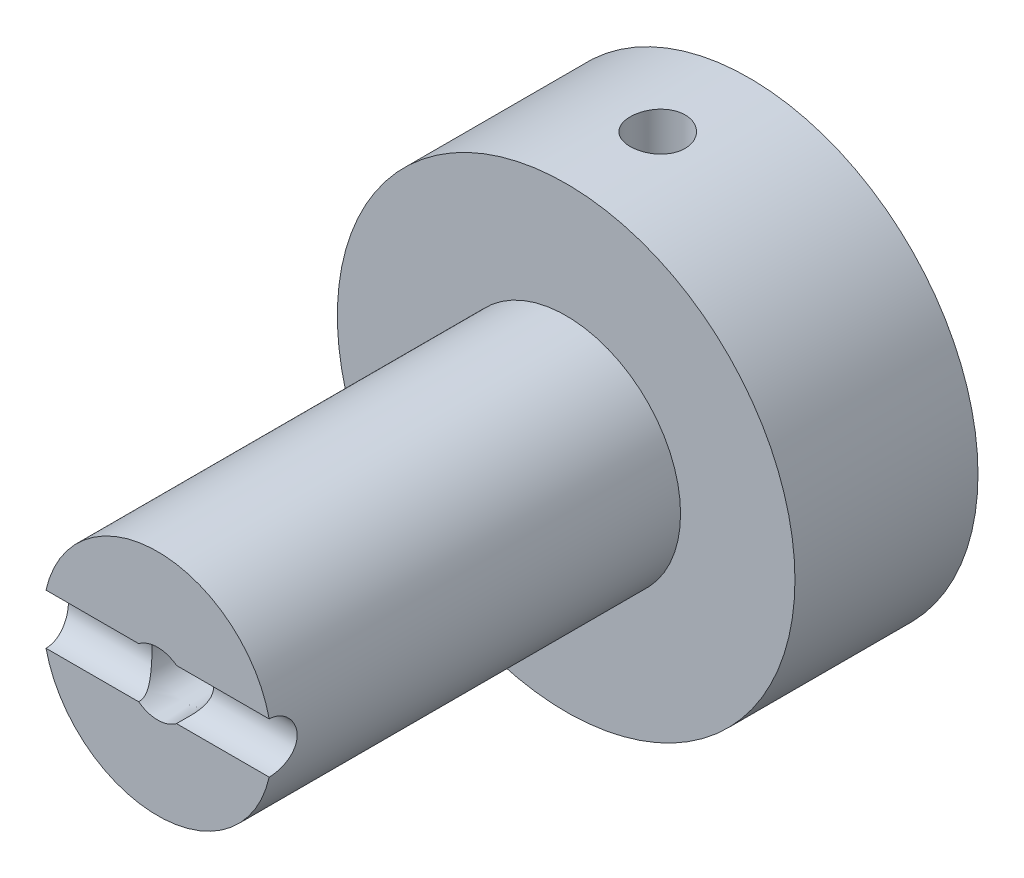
ISO-10303-21;
HEADER;
FILE_DESCRIPTION(('STEP AP214'),'2;1');
FILE_NAME('part.step','',(''),(''),'','','');
FILE_SCHEMA(('AUTOMOTIVE_DESIGN { 1 0 10303 214 1 1 1 1 }'));
ENDSEC;
DATA;
#1=APPLICATION_CONTEXT('core data for automotive mechanical design processes');
#2=APPLICATION_PROTOCOL_DEFINITION('international standard','automotive_design',2000,#1);
#3=PRODUCT_CONTEXT('',#1,'mechanical');
#4=PRODUCT('Part','Part','',(#3));
#5=PRODUCT_RELATED_PRODUCT_CATEGORY('part','',(#4));
#6=PRODUCT_DEFINITION_FORMATION('','',#4);
#7=PRODUCT_DEFINITION_CONTEXT('part definition',#1,'design');
#8=PRODUCT_DEFINITION('design','',#6,#7);
#9=PRODUCT_DEFINITION_SHAPE('','',#8);
#10=(LENGTH_UNIT() NAMED_UNIT(*) SI_UNIT(.MILLI.,.METRE.));
#11=(NAMED_UNIT(*) PLANE_ANGLE_UNIT() SI_UNIT($,.RADIAN.));
#12=(NAMED_UNIT(*) SI_UNIT($,.STERADIAN.) SOLID_ANGLE_UNIT());
#13=UNCERTAINTY_MEASURE_WITH_UNIT(LENGTH_MEASURE(1.E-05),#10,'distance_accuracy_value','');
#14=(GEOMETRIC_REPRESENTATION_CONTEXT(3) GLOBAL_UNCERTAINTY_ASSIGNED_CONTEXT((#13)) GLOBAL_UNIT_ASSIGNED_CONTEXT((#10,
#11,#12)) REPRESENTATION_CONTEXT('',''));
#15=CARTESIAN_POINT('',(0.,0.,0.));
#16=DIRECTION('',(0.,0.,1.));
#17=DIRECTION('',(1.,0.,0.));
#18=AXIS2_PLACEMENT_3D('',#15,#16,#17);
#19=CARTESIAN_POINT('',(0.,0.,20.));
#20=DIRECTION('',(0.,0.,-1.));
#21=DIRECTION('',(-1.,0.,0.));
#22=AXIS2_PLACEMENT_3D('',#19,#20,#21);
#23=CYLINDRICAL_SURFACE('',#22,25.);
#24=CARTESIAN_POINT('',(0.,0.,0.));
#25=DIRECTION('',(0.,0.,1.));
#26=DIRECTION('',(1.,0.,0.));
#27=AXIS2_PLACEMENT_3D('',#24,#25,#26);
#28=CIRCLE('',#27,25.);
#29=CARTESIAN_POINT('',(25.,0.,0.));
#30=VERTEX_POINT('',#29);
#31=EDGE_CURVE('E108',#30,#30,#28,.T.);
#32=ORIENTED_EDGE('',*,*,#31,.T.);
#33=EDGE_LOOP('',(#32));
#34=FACE_BOUND('',#33,.T.);
#35=CARTESIAN_POINT('',(0.,0.,20.));
#36=DIRECTION('',(0.,0.,1.));
#37=DIRECTION('',(1.,0.,0.));
#38=AXIS2_PLACEMENT_3D('',#35,#36,#37);
#39=CIRCLE('',#38,25.);
#40=CARTESIAN_POINT('',(25.,0.,20.));
#41=VERTEX_POINT('',#40);
#42=EDGE_CURVE('E48',#41,#41,#39,.T.);
#43=ORIENTED_EDGE('',*,*,#42,.F.);
#44=EDGE_LOOP('',(#43));
#45=FACE_BOUND('',#44,.T.);
#46=CARTESIAN_POINT('',(0.,25.,13.));
#47=CARTESIAN_POINT('',(0.167864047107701,24.9999977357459,12.9999928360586));
#48=CARTESIAN_POINT('',(0.335834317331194,24.9982914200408,12.9858633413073));
#49=CARTESIAN_POINT('',(0.667104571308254,24.991648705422,12.9297189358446));
#50=CARTESIAN_POINT('',(0.830399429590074,24.9867088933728,12.8876745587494));
#51=CARTESIAN_POINT('',(1.14747479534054,24.9741559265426,12.776953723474));
#52=CARTESIAN_POINT('',(1.30126148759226,24.9665445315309,12.7082947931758));
#53=CARTESIAN_POINT('',(1.595099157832,24.9494959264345,12.5463312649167));
#54=CARTESIAN_POINT('',(1.73515256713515,24.9400590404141,12.4530310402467));
#55=CARTESIAN_POINT('',(1.99829131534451,24.920360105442,12.2439251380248));
#56=CARTESIAN_POINT('',(2.1212966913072,24.9100945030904,12.1280191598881));
#57=CARTESIAN_POINT('',(2.34615931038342,24.8899239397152,11.8772070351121));
#58=CARTESIAN_POINT('',(2.44801549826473,24.8800189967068,11.7422999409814));
#59=CARTESIAN_POINT('',(2.62798342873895,24.8616560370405,11.4567991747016));
#60=CARTESIAN_POINT('',(2.70602075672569,24.8532025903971,11.3061582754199));
#61=CARTESIAN_POINT('',(2.8356605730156,24.8387461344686,10.9937912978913));
#62=CARTESIAN_POINT('',(2.88726398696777,24.8327430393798,10.8320656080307));
#63=CARTESIAN_POINT('',(2.962329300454,24.8239006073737,10.5029471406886));
#64=CARTESIAN_POINT('',(2.98592577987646,24.8210461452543,10.3355854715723));
#65=CARTESIAN_POINT('',(3.0047237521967,24.8187777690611,9.99925506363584));
#66=CARTESIAN_POINT('',(2.99992630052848,24.8193637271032,9.83028638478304));
#67=CARTESIAN_POINT('',(2.96218316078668,24.8238961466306,9.49647403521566));
#68=CARTESIAN_POINT('',(2.92938543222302,24.8278249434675,9.33161336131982));
#69=CARTESIAN_POINT('',(2.83680346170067,24.8385728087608,9.00975297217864));
#70=CARTESIAN_POINT('',(2.77701871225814,24.8453919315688,8.852753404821));
#71=CARTESIAN_POINT('',(2.63199980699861,24.8611722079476,8.55061053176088));
#72=CARTESIAN_POINT('',(2.54670106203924,24.8701387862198,8.40549852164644));
#73=CARTESIAN_POINT('',(2.35312173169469,24.8891993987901,8.13159278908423));
#74=CARTESIAN_POINT('',(2.24484017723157,24.8992934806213,8.00279975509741));
#75=CARTESIAN_POINT('',(2.00754755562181,24.9195503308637,7.76432891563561));
#76=CARTESIAN_POINT('',(1.87840890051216,24.929713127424,7.65477803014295));
#77=CARTESIAN_POINT('',(1.60350795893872,24.9489020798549,7.4588884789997));
#78=CARTESIAN_POINT('',(1.45774563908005,24.9579282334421,7.37254985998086));
#79=CARTESIAN_POINT('',(1.15363930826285,24.9738318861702,7.22553671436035));
#80=CARTESIAN_POINT('',(0.995291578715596,24.9807087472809,7.16486980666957));
#81=CARTESIAN_POINT('',(0.670556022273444,24.991533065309,7.07102126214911));
#82=CARTESIAN_POINT('',(0.504168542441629,24.9954806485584,7.03783843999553));
#83=CARTESIAN_POINT('',(0.169174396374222,24.9999852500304,7.00006374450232));
#84=CARTESIAN_POINT('',(0.00058772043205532,25.0005630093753,6.99529696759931));
#85=CARTESIAN_POINT('',(-0.334982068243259,24.9983187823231,7.01402857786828));
#86=CARTESIAN_POINT('',(-0.501965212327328,24.9954968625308,7.03752641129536));
#87=CARTESIAN_POINT('',(-0.829074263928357,24.9867833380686,7.1119749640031));
#88=CARTESIAN_POINT('',(-0.989219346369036,24.9809010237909,7.16284261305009));
#89=CARTESIAN_POINT('',(-1.29870539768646,24.9667255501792,7.29050070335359));
#90=CARTESIAN_POINT('',(-1.44804602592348,24.9584323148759,7.36729196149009));
#91=CARTESIAN_POINT('',(-1.73246717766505,24.9403085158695,7.54504291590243));
#92=CARTESIAN_POINT('',(-1.86747628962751,24.9304708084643,7.64611613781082));
#93=CARTESIAN_POINT('',(-2.11867625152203,24.9103817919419,7.86940084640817));
#94=CARTESIAN_POINT('',(-2.23486641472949,24.9001304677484,7.99161310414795));
#95=CARTESIAN_POINT('',(-2.44574795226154,24.8803059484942,8.25447561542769));
#96=CARTESIAN_POINT('',(-2.54032363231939,24.8707365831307,8.39521901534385));
#97=CARTESIAN_POINT('',(-2.70449314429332,24.8534214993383,8.69069502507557));
#98=CARTESIAN_POINT('',(-2.77408744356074,24.8456757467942,8.84542737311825));
#99=CARTESIAN_POINT('',(-2.88612996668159,24.8329105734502,9.1641106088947));
#100=CARTESIAN_POINT('',(-2.92864420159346,24.8278845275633,9.3280380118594));
#101=CARTESIAN_POINT('',(-2.98553272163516,24.8211085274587,9.66076896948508));
#102=CARTESIAN_POINT('',(-2.99990820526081,24.8193584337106,9.82957231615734));
#103=CARTESIAN_POINT('',(-3.00009033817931,24.819336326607,10.1661127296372));
#104=CARTESIAN_POINT('',(-2.98607873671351,24.8210421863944,10.3338497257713));
#105=CARTESIAN_POINT('',(-2.93026848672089,24.8276922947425,10.6645667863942));
#106=CARTESIAN_POINT('',(-2.88846982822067,24.8326365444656,10.8275468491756));
#107=CARTESIAN_POINT('',(-2.77832739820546,24.8451996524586,11.1441045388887));
#108=CARTESIAN_POINT('',(-2.7099916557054,24.8528177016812,11.2976849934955));
#109=CARTESIAN_POINT('',(-2.5487328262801,24.8698714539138,11.5912277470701));
#110=CARTESIAN_POINT('',(-2.45580952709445,24.8793071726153,11.7311899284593));
#111=CARTESIAN_POINT('',(-2.24733689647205,24.8990055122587,11.9944529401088));
#112=CARTESIAN_POINT('',(-2.13165203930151,24.9092728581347,12.1176461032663));
#113=CARTESIAN_POINT('',(-1.88122093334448,24.9294354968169,12.342942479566));
#114=CARTESIAN_POINT('',(-1.74647018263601,24.939330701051,12.4450406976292));
#115=CARTESIAN_POINT('',(-1.46119322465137,24.9576721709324,12.6255505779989));
#116=CARTESIAN_POINT('',(-1.31061323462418,24.966113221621,12.7038777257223));
#117=CARTESIAN_POINT('',(-0.998422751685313,24.9805418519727,12.8340237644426));
#118=CARTESIAN_POINT('',(-0.836824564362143,24.9865321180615,12.8858716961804));
#119=CARTESIAN_POINT('',(-0.561977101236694,24.9939268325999,12.9490634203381));
#120=CARTESIAN_POINT('',(-0.450466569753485,24.996193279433,12.9681374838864));
#121=CARTESIAN_POINT('',(-0.225986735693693,24.9992306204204,12.993608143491));
#122=CARTESIAN_POINT('',(-0.113017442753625,25.0000015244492,13.0000048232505));
#123=CARTESIAN_POINT('',(0.,25.,13.));
#124=B_SPLINE_CURVE_WITH_KNOTS('',3,(#46,#47,#48,#49,#50,#51,#52,#53,#54,#55,#56,#57,#58,#59,
#60,#61,#62,#63,#64,#65,#66,#67,#68,#69,#70,#71,#72,#73,#74,#75,#76,#77,#78,#79,#80,#81,#82,#83,
#84,#85,#86,#87,#88,#89,#90,#91,#92,#93,#94,#95,#96,#97,#98,#99,#100,#101,#102,#103,#104,#105,
#106,#107,#108,#109,#110,#111,#112,#113,#114,#115,#116,#117,#118,#119,#120,#121,#122,#123),
.UNSPECIFIED.,.T.,.F.,(4,2,2,2,2,2,2,2,2,2,2,2,2,2,2,2,2,2,2,2,2,2,2,2,2,2,2,2,2,2,2,2,2,2,2,2,
2,2,4),(0.,0.503179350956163,1.00689069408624,1.51027086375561,2.01356175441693,
2.51913872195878,3.02474090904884,3.53190689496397,4.03905511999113,4.54375638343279,
5.0484388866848,5.55047092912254,6.05251241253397,6.55583573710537,7.05918028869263,
7.56572944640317,8.07227962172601,8.57898002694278,9.08565857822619,9.58921522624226,
10.0927620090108,10.5947890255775,11.0968318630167,11.6012692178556,12.1057249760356,
12.6128207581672,13.119907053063,13.6257524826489,14.1315763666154,14.6341719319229,
15.1367676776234,15.6392114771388,16.1416596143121,16.6471952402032,17.1528504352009,
17.6602829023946,18.1671576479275,18.5059342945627,18.8447087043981),.UNSPECIFIED.);
#125=CARTESIAN_POINT('',(0.,25.,13.));
#126=VERTEX_POINT('',#125);
#127=EDGE_CURVE('E11',#126,#126,#124,.T.);
#128=ORIENTED_EDGE('',*,*,#127,.F.);
#129=EDGE_LOOP('',(#128));
#130=FACE_BOUND('',#129,.T.);
#131=ADVANCED_FACE('F37',(#34,#45,#130),#23,.T.);
#132=CARTESIAN_POINT('',(0.,0.,64.64));
#133=DIRECTION('',(0.,0.,1.));
#134=DIRECTION('',(1.,0.,0.));
#135=AXIS2_PLACEMENT_3D('',#132,#133,#134);
#136=PLANE('',#135);
#137=DIRECTION('',(1.,0.,0.));
#138=VECTOR('',#137,1.);
#139=CARTESIAN_POINT('',(-25.001,-2.75,64.64));
#140=LINE('',#139,#138);
#141=CARTESIAN_POINT('',(-12.1937483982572,-2.75,64.64));
#142=VERTEX_POINT('',#141);
#143=CARTESIAN_POINT('',(-2.07108519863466,-2.75,64.64));
#144=VERTEX_POINT('',#143);
#145=EDGE_CURVE('E55',#142,#144,#140,.T.);
#146=ORIENTED_EDGE('',*,*,#145,.F.);
#147=CARTESIAN_POINT('',(0.,0.,64.64));
#148=DIRECTION('',(0.,0.,1.));
#149=DIRECTION('',(1.,0.,0.));
#150=AXIS2_PLACEMENT_3D('',#147,#148,#149);
#151=CIRCLE('',#150,12.5);
#152=CARTESIAN_POINT('',(12.1937483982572,-2.75,64.64));
#153=VERTEX_POINT('',#152);
#154=EDGE_CURVE('E120',#142,#153,#151,.T.);
#155=ORIENTED_EDGE('',*,*,#154,.T.);
#156=DIRECTION('',(-1.,0.,0.));
#157=VECTOR('',#156,1.);
#158=CARTESIAN_POINT('',(25.001,-2.75,64.64));
#159=LINE('',#158,#157);
#160=CARTESIAN_POINT('',(2.07108519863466,-2.75,64.64));
#161=VERTEX_POINT('',#160);
#162=EDGE_CURVE('E132',#153,#161,#159,.T.);
#163=ORIENTED_EDGE('',*,*,#162,.T.);
#164=CARTESIAN_POINT('',(0.,0.,64.64));
#165=DIRECTION('',(0.,0.,-1.));
#166=DIRECTION('',(-1.,0.,0.));
#167=AXIS2_PLACEMENT_3D('',#164,#165,#166);
#168=CIRCLE('',#167,3.44265797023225);
#169=EDGE_CURVE('E124',#161,#144,#168,.T.);
#170=ORIENTED_EDGE('',*,*,#169,.T.);
#171=EDGE_LOOP('',(#146,#155,#163,#170));
#172=FACE_BOUND('',#171,.T.);
#173=ADVANCED_FACE('F96',(#172),#136,.T.);
#174=CARTESIAN_POINT('',(0.,0.,64.64));
#175=DIRECTION('',(0.,0.,-1.));
#176=DIRECTION('',(-1.,0.,0.));
#177=AXIS2_PLACEMENT_3D('',#174,#175,#176);
#178=CYLINDRICAL_SURFACE('',#177,12.5);
#179=CARTESIAN_POINT('',(0.,0.,20.));
#180=DIRECTION('',(0.,0.,1.));
#181=DIRECTION('',(1.,0.,0.));
#182=AXIS2_PLACEMENT_3D('',#179,#180,#181);
#183=CIRCLE('',#182,12.5);
#184=CARTESIAN_POINT('',(12.5,0.,20.));
#185=VERTEX_POINT('',#184);
#186=EDGE_CURVE('E121',#185,#185,#183,.T.);
#187=ORIENTED_EDGE('',*,*,#186,.T.);
#188=EDGE_LOOP('',(#187));
#189=FACE_BOUND('',#188,.T.);
#190=ORIENTED_EDGE('',*,*,#154,.F.);
#191=CARTESIAN_POINT('',(-12.1937483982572,2.75,64.64));
#192=CARTESIAN_POINT('',(-12.1937410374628,2.75000849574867,64.5636542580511));
#193=CARTESIAN_POINT('',(-12.1944652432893,2.74682083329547,64.4873133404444));
#194=CARTESIAN_POINT('',(-12.1973222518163,2.73411912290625,64.3351965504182));
#195=CARTESIAN_POINT('',(-12.1994548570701,2.72460596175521,64.2594206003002));
#196=CARTESIAN_POINT('',(-12.2050694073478,2.69934052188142,64.1090945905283));
#197=CARTESIAN_POINT('',(-12.2085490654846,2.68359881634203,64.0345426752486));
#198=CARTESIAN_POINT('',(-12.2167489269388,2.64601824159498,63.8870825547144));
#199=CARTESIAN_POINT('',(-12.2214691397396,2.62417932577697,63.81417436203));
#200=CARTESIAN_POINT('',(-12.237296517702,2.54974208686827,63.5986742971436));
#201=CARTESIAN_POINT('',(-12.250075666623,2.48820109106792,63.4591760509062));
#202=CARTESIAN_POINT('',(-12.2786406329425,2.3431627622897,63.1925310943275));
#203=CARTESIAN_POINT('',(-12.294426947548,2.25966179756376,63.0653864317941));
#204=CARTESIAN_POINT('',(-12.3275275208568,2.07154583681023,62.8248281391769));
#205=CARTESIAN_POINT('',(-12.3448613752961,1.96662887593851,62.7116529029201));
#206=CARTESIAN_POINT('',(-12.3789336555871,1.73930680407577,62.5043538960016));
#207=CARTESIAN_POINT('',(-12.3956719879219,1.61689896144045,62.4102331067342));
#208=CARTESIAN_POINT('',(-12.4268809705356,1.35646041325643,62.2427660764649));
#209=CARTESIAN_POINT('',(-12.4413256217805,1.21827745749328,62.1696513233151));
#210=CARTESIAN_POINT('',(-12.4660959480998,0.931222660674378,62.0477752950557));
#211=CARTESIAN_POINT('',(-12.4764223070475,0.782352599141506,61.999009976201));
#212=CARTESIAN_POINT('',(-12.4916542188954,0.480644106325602,61.9279679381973));
#213=CARTESIAN_POINT('',(-12.4966430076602,0.327905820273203,61.9052840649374));
#214=CARTESIAN_POINT('',(-12.5009261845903,0.0207121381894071,61.8857756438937));
#215=CARTESIAN_POINT('',(-12.5002211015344,-0.133743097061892,61.8889486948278));
#216=CARTESIAN_POINT('',(-12.4932593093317,-0.437171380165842,61.9207621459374));
#217=CARTESIAN_POINT('',(-12.4870984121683,-0.586193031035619,61.948963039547));
#218=CARTESIAN_POINT('',(-12.4700265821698,-0.877334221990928,62.0293308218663));
#219=CARTESIAN_POINT('',(-12.4591154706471,-1.01945350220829,62.0814986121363));
#220=CARTESIAN_POINT('',(-12.4336152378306,-1.29397667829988,62.208707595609));
#221=CARTESIAN_POINT('',(-12.4189994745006,-1.42630082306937,62.2839153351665));
#222=CARTESIAN_POINT('',(-12.3876924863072,-1.67660651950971,62.4549431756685));
#223=CARTESIAN_POINT('',(-12.371001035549,-1.79458650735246,62.5507655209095));
#224=CARTESIAN_POINT('',(-12.3369642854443,-2.01546020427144,62.7626800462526));
#225=CARTESIAN_POINT('',(-12.3196126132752,-2.11798634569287,62.8791546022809));
#226=CARTESIAN_POINT('',(-12.2865336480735,-2.30214557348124,63.1278599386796));
#227=CARTESIAN_POINT('',(-12.2708068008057,-2.38377293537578,63.2600950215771));
#228=CARTESIAN_POINT('',(-12.2427381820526,-2.52398750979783,63.5371871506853));
#229=CARTESIAN_POINT('',(-12.2304087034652,-2.58249137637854,63.682087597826));
#230=CARTESIAN_POINT('',(-12.2107029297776,-2.67412940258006,63.9799080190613));
#231=CARTESIAN_POINT('',(-12.2033192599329,-2.70730134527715,64.132815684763));
#232=CARTESIAN_POINT('',(-12.197154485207,-2.73485998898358,64.3458211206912));
#233=CARTESIAN_POINT('',(-12.1958788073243,-2.74053912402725,64.4045567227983));
#234=CARTESIAN_POINT('',(-12.1941763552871,-2.74810453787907,64.5221858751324));
#235=CARTESIAN_POINT('',(-12.1937481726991,-2.74999710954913,64.581079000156));
#236=CARTESIAN_POINT('',(-12.1937483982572,-2.75,64.64));
#237=B_SPLINE_CURVE_WITH_KNOTS('',3,(#191,#192,#193,#194,#195,#196,#197,#198,#199,#200,#201,
#202,#203,#204,#205,#206,#207,#208,#209,#210,#211,#212,#213,#214,#215,#216,#217,#218,#219,#220,
#221,#222,#223,#224,#225,#226,#227,#228,#229,#230,#231,#232,#233,#234,#235,#236),.UNSPECIFIED.,
.F.,.F.,(4,2,2,2,2,2,2,2,2,2,2,2,2,2,2,2,2,2,2,2,2,2,4),(0.,0.228958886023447,0.457885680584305,
0.686425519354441,0.914967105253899,1.37165671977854,1.82842190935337,2.29213788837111,
2.7559263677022,3.2246453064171,3.69328637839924,4.15450774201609,4.61568627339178,
5.06892298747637,5.52217675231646,5.97878746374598,6.43544791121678,6.90166920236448,
7.36801806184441,7.83603281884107,8.30334815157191,8.4803180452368,8.65699358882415),.UNSPECIFIED.);
#238=CARTESIAN_POINT('',(-12.1937483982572,2.75,64.64));
#239=VERTEX_POINT('',#238);
#240=EDGE_CURVE('E168',#239,#142,#237,.T.);
#241=ORIENTED_EDGE('',*,*,#240,.F.);
#242=CARTESIAN_POINT('',(12.1937483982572,2.75,64.64));
#243=VERTEX_POINT('',#242);
#244=EDGE_CURVE('E115',#243,#239,#151,.T.);
#245=ORIENTED_EDGE('',*,*,#244,.F.);
#246=CARTESIAN_POINT('',(12.1937483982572,2.75,64.64));
#247=CARTESIAN_POINT('',(12.1937410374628,2.75000849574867,64.5636542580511));
#248=CARTESIAN_POINT('',(12.1944652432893,2.74682083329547,64.4873133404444));
#249=CARTESIAN_POINT('',(12.1973222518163,2.73411912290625,64.3351965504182));
#250=CARTESIAN_POINT('',(12.1994548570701,2.72460596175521,64.2594206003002));
#251=CARTESIAN_POINT('',(12.2050694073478,2.69934052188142,64.1090945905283));
#252=CARTESIAN_POINT('',(12.2085490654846,2.68359881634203,64.0345426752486));
#253=CARTESIAN_POINT('',(12.2167489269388,2.64601824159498,63.8870825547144));
#254=CARTESIAN_POINT('',(12.2214691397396,2.62417932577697,63.81417436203));
#255=CARTESIAN_POINT('',(12.237296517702,2.54974208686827,63.5986742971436));
#256=CARTESIAN_POINT('',(12.250075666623,2.48820109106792,63.4591760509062));
#257=CARTESIAN_POINT('',(12.2786406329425,2.3431627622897,63.1925310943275));
#258=CARTESIAN_POINT('',(12.294426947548,2.25966179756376,63.0653864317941));
#259=CARTESIAN_POINT('',(12.3275275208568,2.07154583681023,62.8248281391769));
#260=CARTESIAN_POINT('',(12.3448613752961,1.96662887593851,62.7116529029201));
#261=CARTESIAN_POINT('',(12.3789336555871,1.73930680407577,62.5043538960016));
#262=CARTESIAN_POINT('',(12.3956719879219,1.61689896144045,62.4102331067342));
#263=CARTESIAN_POINT('',(12.4268809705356,1.35646041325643,62.2427660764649));
#264=CARTESIAN_POINT('',(12.4413256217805,1.21827745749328,62.1696513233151));
#265=CARTESIAN_POINT('',(12.4660959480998,0.931222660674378,62.0477752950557));
#266=CARTESIAN_POINT('',(12.4764223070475,0.782352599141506,61.999009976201));
#267=CARTESIAN_POINT('',(12.4916542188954,0.480644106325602,61.9279679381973));
#268=CARTESIAN_POINT('',(12.4966430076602,0.327905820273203,61.9052840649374));
#269=CARTESIAN_POINT('',(12.5009261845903,0.0207121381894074,61.8857756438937));
#270=CARTESIAN_POINT('',(12.5002211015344,-0.133743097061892,61.8889486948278));
#271=CARTESIAN_POINT('',(12.4932593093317,-0.437171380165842,61.9207621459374));
#272=CARTESIAN_POINT('',(12.4870984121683,-0.58619303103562,61.948963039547));
#273=CARTESIAN_POINT('',(12.4700265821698,-0.877334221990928,62.0293308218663));
#274=CARTESIAN_POINT('',(12.4591154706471,-1.01945350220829,62.0814986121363));
#275=CARTESIAN_POINT('',(12.4336152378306,-1.29397667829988,62.208707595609));
#276=CARTESIAN_POINT('',(12.4189994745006,-1.42630082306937,62.2839153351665));
#277=CARTESIAN_POINT('',(12.3876924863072,-1.67660651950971,62.4549431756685));
#278=CARTESIAN_POINT('',(12.3710010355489,-1.79458650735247,62.5507655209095));
#279=CARTESIAN_POINT('',(12.3369642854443,-2.01546020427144,62.7626800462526));
#280=CARTESIAN_POINT('',(12.3196126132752,-2.11798634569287,62.8791546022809));
#281=CARTESIAN_POINT('',(12.2865336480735,-2.30214557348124,63.1278599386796));
#282=CARTESIAN_POINT('',(12.2708068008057,-2.38377293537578,63.2600950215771));
#283=CARTESIAN_POINT('',(12.2427381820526,-2.52398750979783,63.5371871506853));
#284=CARTESIAN_POINT('',(12.2304087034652,-2.58249137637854,63.682087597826));
#285=CARTESIAN_POINT('',(12.2107029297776,-2.67412940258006,63.9799080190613));
#286=CARTESIAN_POINT('',(12.2033192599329,-2.70730134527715,64.132815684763));
#287=CARTESIAN_POINT('',(12.197154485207,-2.73485998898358,64.3458211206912));
#288=CARTESIAN_POINT('',(12.1958788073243,-2.74053912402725,64.4045567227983));
#289=CARTESIAN_POINT('',(12.1941763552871,-2.74810453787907,64.5221858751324));
#290=CARTESIAN_POINT('',(12.1937481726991,-2.74999710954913,64.581079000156));
#291=CARTESIAN_POINT('',(12.1937483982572,-2.75,64.64));
#292=B_SPLINE_CURVE_WITH_KNOTS('',3,(#246,#247,#248,#249,#250,#251,#252,#253,#254,#255,#256,
#257,#258,#259,#260,#261,#262,#263,#264,#265,#266,#267,#268,#269,#270,#271,#272,#273,#274,#275,
#276,#277,#278,#279,#280,#281,#282,#283,#284,#285,#286,#287,#288,#289,#290,#291),.UNSPECIFIED.,
.F.,.F.,(4,2,2,2,2,2,2,2,2,2,2,2,2,2,2,2,2,2,2,2,2,2,4),(0.,0.228958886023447,0.457885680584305,
0.686425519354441,0.914967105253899,1.37165671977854,1.82842190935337,2.29213788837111,
2.7559263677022,3.2246453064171,3.69328637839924,4.15450774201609,4.61568627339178,
5.06892298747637,5.52217675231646,5.97878746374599,6.43544791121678,6.90166920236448,
7.36801806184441,7.83603281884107,8.3033481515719,8.48031804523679,8.65699358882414),.UNSPECIFIED.);
#293=EDGE_CURVE('E135',#243,#153,#292,.T.);
#294=ORIENTED_EDGE('',*,*,#293,.T.);
#295=EDGE_LOOP('',(#190,#241,#245,#294));
#296=FACE_BOUND('',#295,.T.);
#297=ADVANCED_FACE('F101',(#189,#296),#178,.T.);
#298=DIRECTION('',(1.,0.,0.));
#299=VECTOR('',#298,1.);
#300=CARTESIAN_POINT('',(-25.001,2.75,64.64));
#301=LINE('',#300,#299);
#302=CARTESIAN_POINT('',(-2.07108519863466,2.75,64.64));
#303=VERTEX_POINT('',#302);
#304=EDGE_CURVE('E173',#239,#303,#301,.T.);
#305=ORIENTED_EDGE('',*,*,#304,.T.);
#306=CARTESIAN_POINT('',(2.07108519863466,2.75,64.64));
#307=VERTEX_POINT('',#306);
#308=EDGE_CURVE('E63',#303,#307,#168,.T.);
#309=ORIENTED_EDGE('',*,*,#308,.T.);
#310=DIRECTION('',(-1.,0.,0.));
#311=VECTOR('',#310,1.);
#312=CARTESIAN_POINT('',(25.001,2.75,64.64));
#313=LINE('',#312,#311);
#314=EDGE_CURVE('E130',#243,#307,#313,.T.);
#315=ORIENTED_EDGE('',*,*,#314,.F.);
#316=ORIENTED_EDGE('',*,*,#244,.T.);
#317=EDGE_LOOP('',(#305,#309,#315,#316));
#318=FACE_BOUND('',#317,.T.);
#319=ADVANCED_FACE('F104',(#318),#136,.T.);
#320=CARTESIAN_POINT('',(0.,0.,0.));
#321=DIRECTION('',(0.,0.,1.));
#322=DIRECTION('',(-1.,0.,0.));
#323=AXIS2_PLACEMENT_3D('',#320,#321,#322);
#324=CONICAL_SURFACE('',#323,1.75,0.026179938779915);
#325=CARTESIAN_POINT('',(0.,0.,0.));
#326=DIRECTION('',(0.,0.,-1.));
#327=DIRECTION('',(-1.,0.,0.));
#328=AXIS2_PLACEMENT_3D('',#325,#326,#327);
#329=CIRCLE('',#328,1.75);
#330=CARTESIAN_POINT('',(-1.75,0.,0.));
#331=VERTEX_POINT('',#330);
#332=EDGE_CURVE('E127',#331,#331,#329,.T.);
#333=ORIENTED_EDGE('',*,*,#332,.T.);
#334=EDGE_LOOP('',(#333));
#335=FACE_BOUND('',#334,.T.);
#336=ORIENTED_EDGE('',*,*,#308,.F.);
#337=CARTESIAN_POINT('',(-2.07109391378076,-2.74999999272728,64.6402));
#338=CARTESIAN_POINT('',(-2.06885727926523,-2.75001519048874,64.5896537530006));
#339=CARTESIAN_POINT('',(-2.06852788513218,-2.74861418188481,64.5390354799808));
#340=CARTESIAN_POINT('',(-2.0715380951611,-2.74304226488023,64.4381287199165));
#341=CARTESIAN_POINT('',(-2.07487268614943,-2.73887514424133,64.3878398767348));
#342=CARTESIAN_POINT('',(-2.08499221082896,-2.72790677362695,64.2885909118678));
#343=CARTESIAN_POINT('',(-2.09173059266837,-2.72114135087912,64.2396220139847));
#344=CARTESIAN_POINT('',(-2.10831202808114,-2.70509532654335,64.142627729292));
#345=CARTESIAN_POINT('',(-2.11815627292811,-2.69581376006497,64.0946027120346));
#346=CARTESIAN_POINT('',(-2.158876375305,-2.6577654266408,63.9222873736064));
#347=CARTESIAN_POINT('',(-2.19786147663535,-2.62191464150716,63.8014064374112));
#348=CARTESIAN_POINT('',(-2.28751006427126,-2.5358823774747,63.5688470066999));
#349=CARTESIAN_POINT('',(-2.33825376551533,-2.48560187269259,63.4572392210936));
#350=CARTESIAN_POINT('',(-2.42968897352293,-2.38887917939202,63.2750732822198));
#351=CARTESIAN_POINT('',(-2.46896847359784,-2.34563020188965,63.2020702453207));
#352=CARTESIAN_POINT('',(-2.54886535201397,-2.25297948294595,63.0608468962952));
#353=CARTESIAN_POINT('',(-2.58948326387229,-2.20357526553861,62.9926285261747));
#354=CARTESIAN_POINT('',(-2.71128030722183,-2.04647622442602,62.7953653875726));
#355=CARTESIAN_POINT('',(-2.79258340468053,-1.92971522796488,62.6733766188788));
#356=CARTESIAN_POINT('',(-2.9344806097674,-1.69361155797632,62.4687176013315));
#357=CARTESIAN_POINT('',(-2.99629855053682,-1.57773194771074,62.3828791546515));
#358=CARTESIAN_POINT('',(-3.10964266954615,-1.33029384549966,62.2287821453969));
#359=CARTESIAN_POINT('',(-3.1611847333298,-1.19876006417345,62.1604963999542));
#360=CARTESIAN_POINT('',(-3.24195869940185,-0.945815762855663,62.0547775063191));
#361=CARTESIAN_POINT('',(-3.27349838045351,-0.826519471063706,62.0140654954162));
#362=CARTESIAN_POINT('',(-3.32412926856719,-0.580970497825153,61.9490771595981));
#363=CARTESIAN_POINT('',(-3.34322761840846,-0.454721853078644,61.9247914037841));
#364=CARTESIAN_POINT('',(-3.36739430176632,-0.198212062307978,61.8941027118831));
#365=CARTESIAN_POINT('',(-3.3724087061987,-0.0679374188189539,61.8877685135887));
#366=CARTESIAN_POINT('',(-3.36778089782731,0.191929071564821,61.8936292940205));
#367=CARTESIAN_POINT('',(-3.35813875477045,0.321520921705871,61.9058241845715));
#368=CARTESIAN_POINT('',(-3.32611025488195,0.568132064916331,61.9466002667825));
#369=CARTESIAN_POINT('',(-3.30453771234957,0.685435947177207,61.9741358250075));
#370=CARTESIAN_POINT('',(-3.25085726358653,0.913222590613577,62.0433276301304));
#371=CARTESIAN_POINT('',(-3.21874680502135,1.02370369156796,62.0849872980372));
#372=CARTESIAN_POINT('',(-3.14275898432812,1.24555282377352,62.184964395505));
#373=CARTESIAN_POINT('',(-3.09808850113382,1.35612400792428,62.244434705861));
#374=CARTESIAN_POINT('',(-3.00140836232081,1.5659257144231,62.3759917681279));
#375=CARTESIAN_POINT('',(-2.94939458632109,1.66514981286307,62.4480856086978));
#376=CARTESIAN_POINT('',(-2.82983801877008,1.87059678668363,62.618946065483));
#377=CARTESIAN_POINT('',(-2.76127985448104,1.97418999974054,62.7201592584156));
#378=CARTESIAN_POINT('',(-2.62253138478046,2.16401665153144,62.9369626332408));
#379=CARTESIAN_POINT('',(-2.55233926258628,2.25022962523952,63.0525695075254));
#380=CARTESIAN_POINT('',(-2.42446567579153,2.39557498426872,63.2834908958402));
#381=CARTESIAN_POINT('',(-2.36627875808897,2.45669100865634,63.3972747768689));
#382=CARTESIAN_POINT('',(-2.25955052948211,2.56352902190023,63.6360852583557));
#383=CARTESIAN_POINT('',(-2.21098893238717,2.60928353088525,63.7610873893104));
#384=CARTESIAN_POINT('',(-2.14300683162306,2.67267189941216,63.9851609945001));
#385=CARTESIAN_POINT('',(-2.11923298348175,2.69459376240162,64.0816683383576));
#386=CARTESIAN_POINT('',(-2.08461659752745,2.72796707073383,64.2786390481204));
#387=CARTESIAN_POINT('',(-2.07373227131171,2.73945232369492,64.3790885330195));
#388=CARTESIAN_POINT('',(-2.06940033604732,2.74689649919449,64.5066447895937));
#389=CARTESIAN_POINT('',(-2.0690158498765,2.74806181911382,64.5333476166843));
#390=CARTESIAN_POINT('',(-2.06928120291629,2.74961387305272,64.5867712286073));
#391=CARTESIAN_POINT('',(-2.0699310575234,2.75000059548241,64.6134920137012));
#392=CARTESIAN_POINT('',(-2.07109391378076,2.74999999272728,64.6402));
#393=B_SPLINE_CURVE_WITH_KNOTS('',3,(#337,#338,#339,#340,#341,#342,#343,#344,#345,#346,#347,
#348,#349,#350,#351,#352,#353,#354,#355,#356,#357,#358,#359,#360,#361,#362,#363,#364,#365,#366,
#367,#368,#369,#370,#371,#372,#373,#374,#375,#376,#377,#378,#379,#380,#381,#382,#383,#384,#385,
#386,#387,#388,#389,#390,#391,#392),.UNSPECIFIED.,.F.,.F.,(4,2,2,2,2,2,2,2,2,2,2,2,2,2,2,2,2,2,
2,2,2,2,2,2,2,2,2,4),(0.,0.151713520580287,0.30321972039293,0.452707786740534,0.602253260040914,
0.995788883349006,1.39209256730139,1.6722590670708,1.95253863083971,2.51184731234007,
2.9808174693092,3.44905692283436,3.8372391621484,4.22519834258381,4.61464105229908,
5.00408190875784,5.3697517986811,5.73551032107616,6.13383426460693,6.53238260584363,
7.01137354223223,7.49092523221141,7.91468754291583,8.33754701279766,8.64177067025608,
8.94500529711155,9.02517691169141,9.10534971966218),.UNSPECIFIED.);
#394=EDGE_CURVE('E162',#144,#303,#393,.T.);
#395=ORIENTED_EDGE('',*,*,#394,.F.);
#396=ORIENTED_EDGE('',*,*,#169,.F.);
#397=CARTESIAN_POINT('',(2.07109391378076,-2.74999999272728,64.6402));
#398=CARTESIAN_POINT('',(2.06885727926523,-2.75001519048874,64.5896537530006));
#399=CARTESIAN_POINT('',(2.06852788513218,-2.74861418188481,64.5390354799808));
#400=CARTESIAN_POINT('',(2.0715380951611,-2.74304226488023,64.4381287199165));
#401=CARTESIAN_POINT('',(2.07487268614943,-2.73887514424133,64.3878398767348));
#402=CARTESIAN_POINT('',(2.08499221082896,-2.72790677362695,64.2885909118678));
#403=CARTESIAN_POINT('',(2.09173059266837,-2.72114135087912,64.2396220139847));
#404=CARTESIAN_POINT('',(2.10831202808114,-2.70509532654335,64.142627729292));
#405=CARTESIAN_POINT('',(2.11815627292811,-2.69581376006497,64.0946027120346));
#406=CARTESIAN_POINT('',(2.158876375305,-2.6577654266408,63.9222873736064));
#407=CARTESIAN_POINT('',(2.19786147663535,-2.62191464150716,63.8014064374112));
#408=CARTESIAN_POINT('',(2.28751006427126,-2.5358823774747,63.5688470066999));
#409=CARTESIAN_POINT('',(2.33825376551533,-2.48560187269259,63.4572392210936));
#410=CARTESIAN_POINT('',(2.42968897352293,-2.38887917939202,63.2750732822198));
#411=CARTESIAN_POINT('',(2.46896847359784,-2.34563020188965,63.2020702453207));
#412=CARTESIAN_POINT('',(2.54886535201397,-2.25297948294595,63.0608468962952));
#413=CARTESIAN_POINT('',(2.58948326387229,-2.20357526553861,62.9926285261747));
#414=CARTESIAN_POINT('',(2.71128030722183,-2.04647622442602,62.7953653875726));
#415=CARTESIAN_POINT('',(2.79258340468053,-1.92971522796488,62.6733766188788));
#416=CARTESIAN_POINT('',(2.9344806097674,-1.69361155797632,62.4687176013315));
#417=CARTESIAN_POINT('',(2.99629855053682,-1.57773194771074,62.3828791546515));
#418=CARTESIAN_POINT('',(3.10964266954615,-1.33029384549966,62.2287821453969));
#419=CARTESIAN_POINT('',(3.1611847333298,-1.19876006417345,62.1604963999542));
#420=CARTESIAN_POINT('',(3.24195869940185,-0.945815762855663,62.0547775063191));
#421=CARTESIAN_POINT('',(3.27349838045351,-0.826519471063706,62.0140654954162));
#422=CARTESIAN_POINT('',(3.32412926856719,-0.580970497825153,61.9490771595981));
#423=CARTESIAN_POINT('',(3.34322761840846,-0.454721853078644,61.9247914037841));
#424=CARTESIAN_POINT('',(3.36739430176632,-0.198212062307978,61.8941027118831));
#425=CARTESIAN_POINT('',(3.3724087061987,-0.0679374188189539,61.8877685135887));
#426=CARTESIAN_POINT('',(3.36778089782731,0.191929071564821,61.8936292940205));
#427=CARTESIAN_POINT('',(3.35813875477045,0.321520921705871,61.9058241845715));
#428=CARTESIAN_POINT('',(3.32611025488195,0.568132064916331,61.9466002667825));
#429=CARTESIAN_POINT('',(3.30453771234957,0.685435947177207,61.9741358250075));
#430=CARTESIAN_POINT('',(3.25085726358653,0.913222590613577,62.0433276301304));
#431=CARTESIAN_POINT('',(3.21874680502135,1.02370369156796,62.0849872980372));
#432=CARTESIAN_POINT('',(3.14275898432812,1.24555282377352,62.184964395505));
#433=CARTESIAN_POINT('',(3.09808850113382,1.35612400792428,62.244434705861));
#434=CARTESIAN_POINT('',(3.00140836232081,1.5659257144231,62.3759917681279));
#435=CARTESIAN_POINT('',(2.94939458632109,1.66514981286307,62.4480856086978));
#436=CARTESIAN_POINT('',(2.82983801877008,1.87059678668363,62.618946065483));
#437=CARTESIAN_POINT('',(2.76127985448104,1.97418999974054,62.7201592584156));
#438=CARTESIAN_POINT('',(2.62253138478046,2.16401665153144,62.9369626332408));
#439=CARTESIAN_POINT('',(2.55233926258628,2.25022962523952,63.0525695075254));
#440=CARTESIAN_POINT('',(2.42446567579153,2.39557498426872,63.2834908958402));
#441=CARTESIAN_POINT('',(2.36627875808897,2.45669100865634,63.3972747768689));
#442=CARTESIAN_POINT('',(2.25955052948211,2.56352902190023,63.6360852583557));
#443=CARTESIAN_POINT('',(2.21098893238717,2.60928353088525,63.7610873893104));
#444=CARTESIAN_POINT('',(2.14300683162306,2.67267189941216,63.9851609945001));
#445=CARTESIAN_POINT('',(2.11923298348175,2.69459376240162,64.0816683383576));
#446=CARTESIAN_POINT('',(2.08461659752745,2.72796707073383,64.2786390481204));
#447=CARTESIAN_POINT('',(2.07373227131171,2.73945232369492,64.3790885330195));
#448=CARTESIAN_POINT('',(2.06940033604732,2.74689649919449,64.5066447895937));
#449=CARTESIAN_POINT('',(2.0690158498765,2.74806181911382,64.5333476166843));
#450=CARTESIAN_POINT('',(2.06928120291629,2.74961387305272,64.5867712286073));
#451=CARTESIAN_POINT('',(2.0699310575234,2.75000059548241,64.6134920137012));
#452=CARTESIAN_POINT('',(2.07109391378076,2.74999999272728,64.6402));
#453=B_SPLINE_CURVE_WITH_KNOTS('',3,(#397,#398,#399,#400,#401,#402,#403,#404,#405,#406,#407,
#408,#409,#410,#411,#412,#413,#414,#415,#416,#417,#418,#419,#420,#421,#422,#423,#424,#425,#426,
#427,#428,#429,#430,#431,#432,#433,#434,#435,#436,#437,#438,#439,#440,#441,#442,#443,#444,#445,
#446,#447,#448,#449,#450,#451,#452),.UNSPECIFIED.,.F.,.F.,(4,2,2,2,2,2,2,2,2,2,2,2,2,2,2,2,2,2,
2,2,2,2,2,2,2,2,2,4),(0.,0.151713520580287,0.30321972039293,0.452707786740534,0.602253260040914,
0.995788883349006,1.39209256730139,1.6722590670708,1.95253863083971,2.51184731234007,
2.9808174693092,3.44905692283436,3.8372391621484,4.22519834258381,4.61464105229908,
5.00408190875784,5.3697517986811,5.73551032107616,6.13383426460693,6.53238260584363,
7.01137354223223,7.49092523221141,7.91468754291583,8.33754701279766,8.64177067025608,
8.94500529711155,9.02517691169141,9.10534971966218),.UNSPECIFIED.);
#454=EDGE_CURVE('E143',#161,#307,#453,.T.);
#455=ORIENTED_EDGE('',*,*,#454,.T.);
#456=EDGE_LOOP('',(#336,#395,#396,#455));
#457=FACE_BOUND('',#456,.T.);
#458=ADVANCED_FACE('F178',(#335,#457),#324,.F.);
#459=CARTESIAN_POINT('',(0.,0.,20.));
#460=DIRECTION('',(0.,0.,1.));
#461=DIRECTION('',(1.,0.,0.));
#462=AXIS2_PLACEMENT_3D('',#459,#460,#461);
#463=PLANE('',#462);
#464=ORIENTED_EDGE('',*,*,#42,.T.);
#465=EDGE_LOOP('',(#464));
#466=FACE_BOUND('',#465,.T.);
#467=ORIENTED_EDGE('',*,*,#186,.F.);
#468=EDGE_LOOP('',(#467));
#469=FACE_BOUND('',#468,.T.);
#470=ADVANCED_FACE('F193',(#466,#469),#463,.T.);
#471=CARTESIAN_POINT('',(0.,0.,0.));
#472=DIRECTION('',(0.,0.,1.));
#473=DIRECTION('',(1.,0.,0.));
#474=AXIS2_PLACEMENT_3D('',#471,#472,#473);
#475=PLANE('',#474);
#476=ORIENTED_EDGE('',*,*,#332,.F.);
#477=EDGE_LOOP('',(#476));
#478=FACE_BOUND('',#477,.T.);
#479=ORIENTED_EDGE('',*,*,#31,.F.);
#480=EDGE_LOOP('',(#479));
#481=FACE_BOUND('',#480,.T.);
#482=ADVANCED_FACE('F191',(#478,#481),#475,.F.);
#483=CARTESIAN_POINT('',(25.001,0.,64.64));
#484=DIRECTION('',(-1.,0.,0.));
#485=DIRECTION('',(0.,0.,1.));
#486=AXIS2_PLACEMENT_3D('',#483,#484,#485);
#487=CYLINDRICAL_SURFACE('',#486,2.75);
#488=ORIENTED_EDGE('',*,*,#314,.T.);
#489=ORIENTED_EDGE('',*,*,#454,.F.);
#490=ORIENTED_EDGE('',*,*,#162,.F.);
#491=ORIENTED_EDGE('',*,*,#293,.F.);
#492=EDGE_LOOP('',(#488,#489,#490,#491));
#493=FACE_BOUND('',#492,.T.);
#494=ADVANCED_FACE('F149',(#493),#487,.F.);
#495=CARTESIAN_POINT('',(-25.001,0.,64.64));
#496=DIRECTION('',(1.,0.,0.));
#497=DIRECTION('',(0.,0.,-1.));
#498=AXIS2_PLACEMENT_3D('',#495,#496,#497);
#499=CYLINDRICAL_SURFACE('',#498,2.75);
#500=ORIENTED_EDGE('',*,*,#240,.T.);
#501=ORIENTED_EDGE('',*,*,#145,.T.);
#502=ORIENTED_EDGE('',*,*,#394,.T.);
#503=ORIENTED_EDGE('',*,*,#304,.F.);
#504=EDGE_LOOP('',(#500,#501,#502,#503));
#505=FACE_BOUND('',#504,.T.);
#506=ADVANCED_FACE('F92',(#505),#499,.F.);
#507=CARTESIAN_POINT('',(0.,25.,10.));
#508=DIRECTION('',(0.,1.,0.));
#509=DIRECTION('',(0.,0.,1.));
#510=AXIS2_PLACEMENT_3D('',#507,#508,#509);
#511=CYLINDRICAL_SURFACE('',#510,3.);
#512=CARTESIAN_POINT('',(0.,15.,10.));
#513=DIRECTION('',(0.,1.,0.));
#514=DIRECTION('',(0.,0.,1.));
#515=AXIS2_PLACEMENT_3D('',#512,#513,#514);
#516=CIRCLE('',#515,3.);
#517=CARTESIAN_POINT('',(0.,15.,13.));
#518=VERTEX_POINT('',#517);
#519=EDGE_CURVE('E263',#518,#518,#516,.T.);
#520=ORIENTED_EDGE('',*,*,#519,.F.);
#521=EDGE_LOOP('',(#520));
#522=FACE_BOUND('',#521,.T.);
#523=ORIENTED_EDGE('',*,*,#127,.T.);
#524=EDGE_LOOP('',(#523));
#525=FACE_BOUND('',#524,.T.);
#526=ADVANCED_FACE('F86',(#522,#525),#511,.F.);
#527=CARTESIAN_POINT('',(0.,12.,10.));
#528=DIRECTION('',(0.,1.,0.));
#529=DIRECTION('',(0.,0.,1.));
#530=AXIS2_PLACEMENT_3D('',#527,#528,#529);
#531=CONICAL_SURFACE('',#530,0.,0.785398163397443);
#532=ORIENTED_EDGE('',*,*,#519,.T.);
#533=EDGE_LOOP('',(#532));
#534=FACE_BOUND('',#533,.T.);
#535=CARTESIAN_POINT('',(0.,12.,10.));
#536=VERTEX_POINT('',#535);
#537=VERTEX_LOOP('',#536);
#538=FACE_BOUND('',#537,.T.);
#539=ADVANCED_FACE('F84',(#534,#538),#531,.F.);
#540=CLOSED_SHELL('',(#131,#173,#297,#319,#458,#470,#482,#494,#506,#526,#539));
#541=MANIFOLD_SOLID_BREP('B2',#540);
#542=ADVANCED_BREP_SHAPE_REPRESENTATION('',(#18,#541),#14);
#543=SHAPE_DEFINITION_REPRESENTATION(#9,#542);
ENDSEC;
END-ISO-10303-21;
